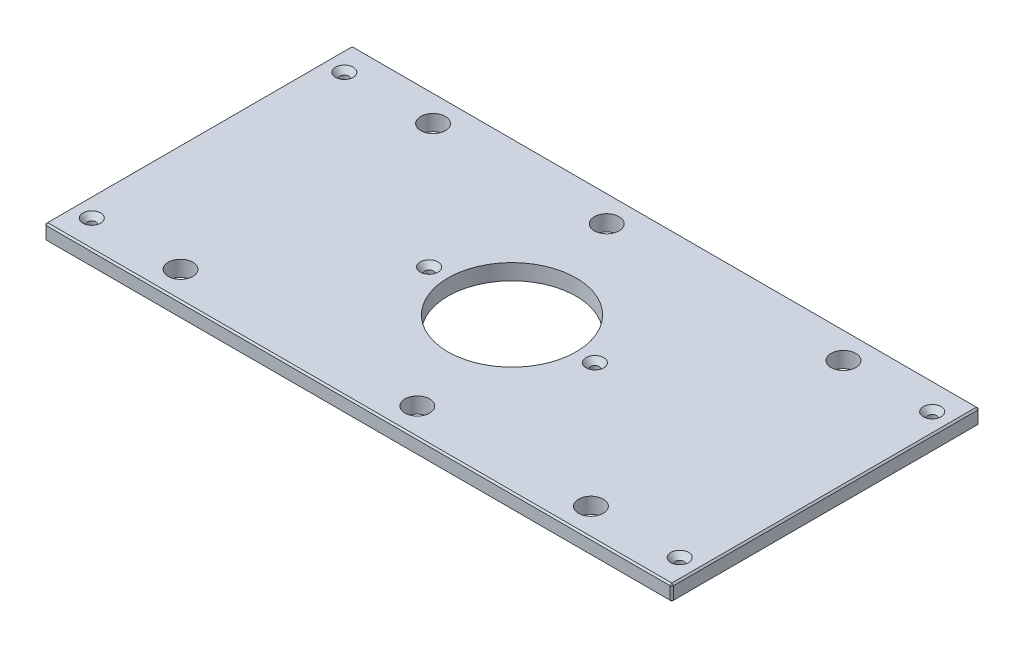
from build123d import *

# Parameters (mm, degrees)
SKETCH1_W                                        = 504.825
SKETCH1_H                                        = 247.65
BOSS_EXTRUDE1_DEPTH                              = 12.7
SKETCH13_R                                       = 51.562
CUT_EXTRUDE6_DEPTH                               = 282.435589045
F_25_32_0_78125_DIAMETER_HOLE1_D                 = 19.84375
CHAMFER2_SIZE                                    = 1.27
CSK_FOR_1_4_FLAT_HEAD_MACHINE_SCREW1_D           = 6.7564
CSK_FOR_1_4_FLAT_HEAD_MACHINE_SCREW1_CSINK_D     = 14.2748
CSK_FOR_1_4_FLAT_HEAD_MACHINE_SCREW1_CSINK_ANGLE = 82


with BuildPart() as part:
    # Sketch1 → Boss-Extrude1 (new body)
    with BuildSketch(Plane(origin=(0, 0, 0), x_dir=(1, 0, 0), z_dir=(0, 1, 0))):
        Rectangle(SKETCH1_W, SKETCH1_H)
    extrude(amount=BOSS_EXTRUDE1_DEPTH)

    # Sketch13 → Cut-Extrude6 (cut, through all)
    with BuildSketch(Plane(origin=(0, 12.7, 0), x_dir=(1, 0, 0), z_dir=(0, 1, 0))):
        with Locations(Location((0, 0, 0), (0, 0, 270))):
            Circle(SKETCH13_R)
    extrude(amount=-CUT_EXTRUDE6_DEPTH, mode=Mode.SUBTRACT)

    # 25_32 _0.78125_ Diameter Hole1 (through all)
    with Locations(Plane(origin=(0, 12.7, 0), x_dir=(1, 0, 0), z_dir=(0, 1, 0))):
        with Locations((165.1, 101.6), (-165.1, 101.6), (165.1, -101.6), (-165.1, -101.6), (-25.4, 101.6), (25.4, -101.6)):
            Hole(F_25_32_0_78125_DIAMETER_HOLE1_D / 2)

    # Chamfer2
    chamfer2_edges = [part.edges().sort_by_distance(p)[0] for p in [
        (252.4125, 12.7, 0),
        (0, 12.7, -123.825),
        (-252.4125, 12.7, 0),
        (0, 0, -123.825),
        (252.4125, 0, 0),
        (0, 0, 123.825),
        (-252.4125, 0, 0),
        (0, 12.7, 123.825),
        (-252.4125, 6.35, -123.825),
        (252.4125, 6.35, -123.825),
        (252.4125, 6.35, 123.825),
        (-252.4125, 6.35, 123.825),
    ]]
    chamfer(chamfer2_edges, length=CHAMFER2_SIZE)

    # CSK for 1_4 Flat Head Machine Screw1 (through all)
    with Locations(Plane(origin=(0, 12.7, 0), x_dir=(1, 0, 0), z_dir=(0, 1, 0))):
        with Locations((236.5375, 101.6), (236.5375, -101.6), (-236.5375, -101.6), (-66.675, 0), (66.675, 0), (-236.5375, 101.6), (-165.1, 101.6), (-165.1, -101.6)):
            CounterSinkHole(CSK_FOR_1_4_FLAT_HEAD_MACHINE_SCREW1_D / 2, CSK_FOR_1_4_FLAT_HEAD_MACHINE_SCREW1_CSINK_D / 2, counter_sink_angle=CSK_FOR_1_4_FLAT_HEAD_MACHINE_SCREW1_CSINK_ANGLE)


solid = part.part
